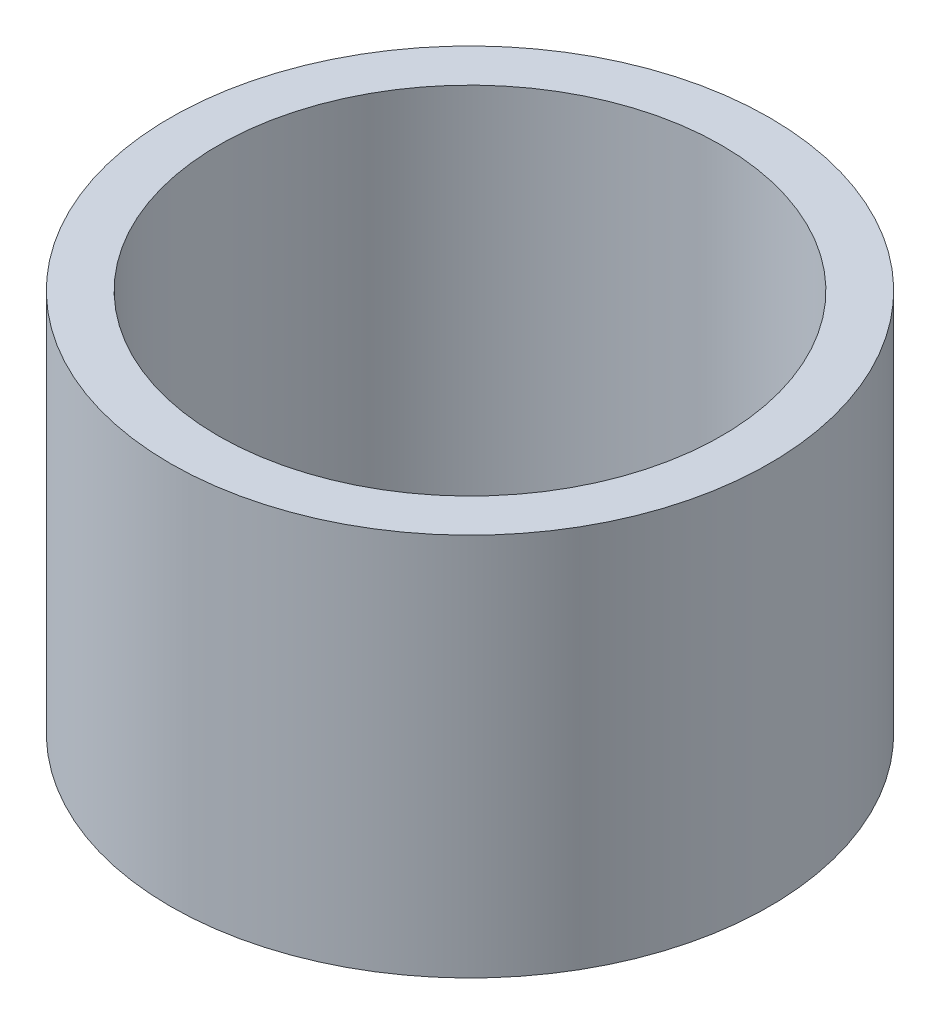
from build123d import *

# Parameters (mm, degrees)
SKETCH1_R           = 7.9375
SKETCH1_R_2         = 6.6675
BOSS_EXTRUDE1_DEPTH = 10.16


with BuildPart() as part:
    # Sketch1 → Boss-Extrude1 (new body)
    with BuildSketch(Plane(origin=(0, 0, 0), x_dir=(1, 0, 0), z_dir=(0, 1, 0))):
        with Locations(Location((0, 0, 0), (0, 0, 270))):
            Circle(SKETCH1_R)
        with Locations(Location((0, 0, 0), (0, 0, 270))):
            Circle(SKETCH1_R_2, mode=Mode.SUBTRACT)
    extrude(amount=BOSS_EXTRUDE1_DEPTH)


solid = part.part
